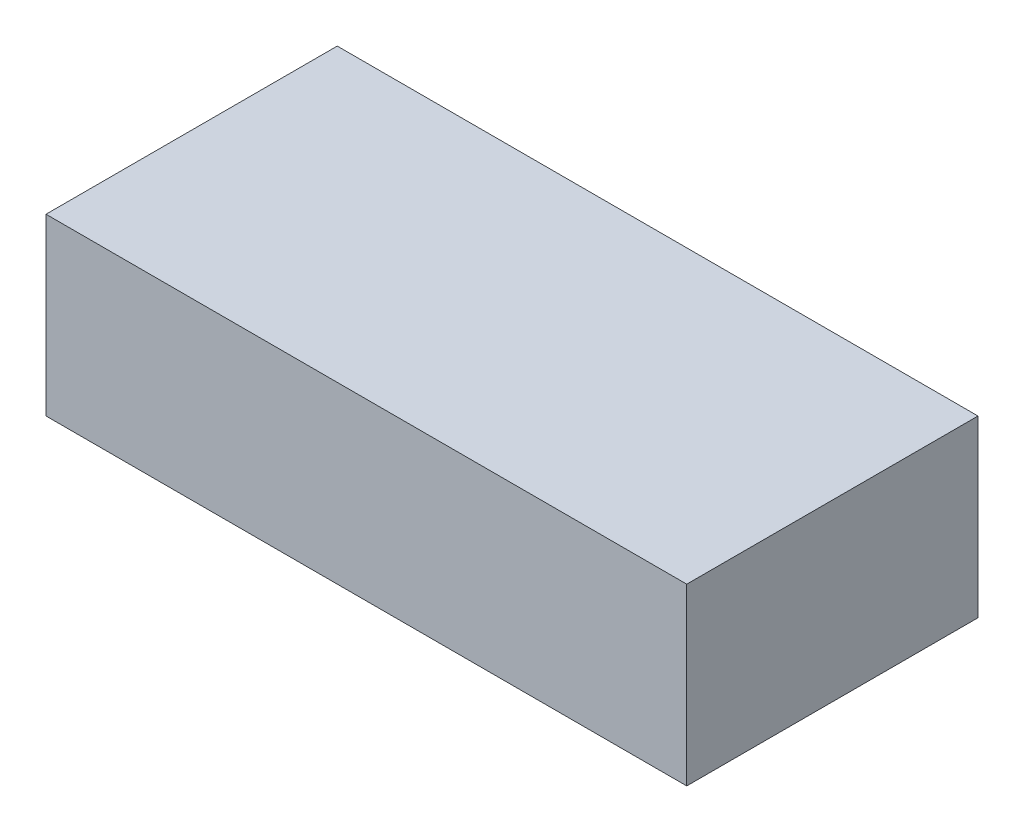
from build123d import *

# Parameters (mm, degrees)
SKETCH2_W      = 139.7
SKETCH2_H      = 63.5
EXTRUDE1_DEPTH = 38.1


with BuildPart() as part:
    # Sketch2 → Extrude1 (new body)
    with BuildSketch(Plane(origin=(0, 0, 0), x_dir=(1, 0, 0), z_dir=(0, 1, 0))):
        with Locations((-69.85, 31.75)):
            Rectangle(SKETCH2_W, SKETCH2_H)
    extrude(amount=EXTRUDE1_DEPTH)


solid = part.part
